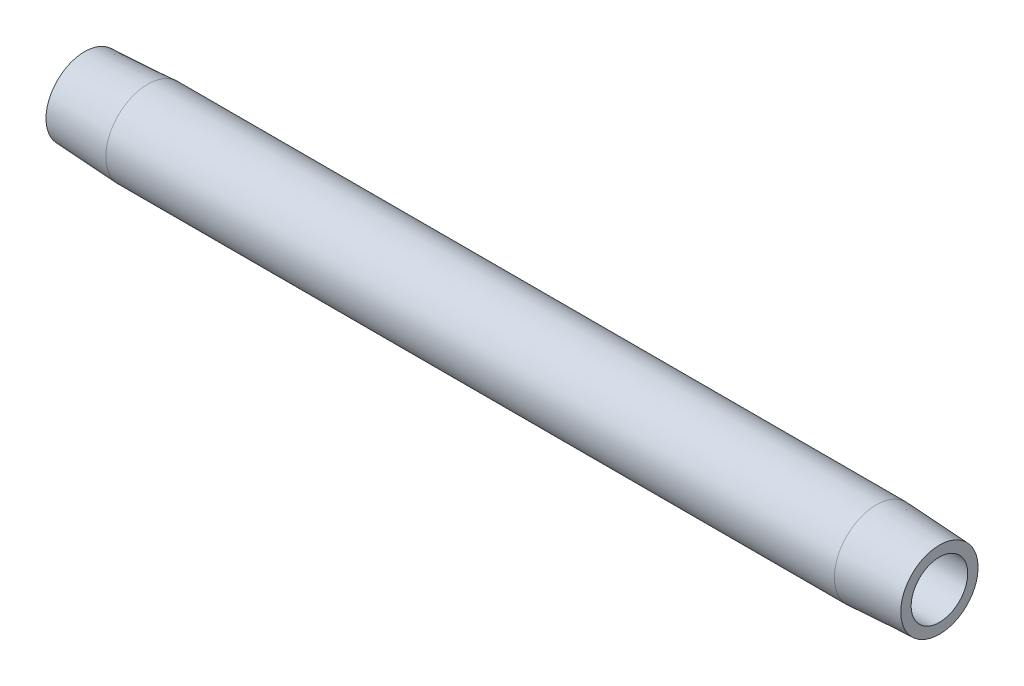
ISO-10303-21;
HEADER;
FILE_DESCRIPTION(('STEP AP214'),'2;1');
FILE_NAME('part.step','',(''),(''),'','','');
FILE_SCHEMA(('AUTOMOTIVE_DESIGN { 1 0 10303 214 1 1 1 1 }'));
ENDSEC;
DATA;
#1=APPLICATION_CONTEXT('core data for automotive mechanical design processes');
#2=APPLICATION_PROTOCOL_DEFINITION('international standard','automotive_design',2000,#1);
#3=PRODUCT_CONTEXT('',#1,'mechanical');
#4=PRODUCT('Part','Part','',(#3));
#5=PRODUCT_RELATED_PRODUCT_CATEGORY('part','',(#4));
#6=PRODUCT_DEFINITION_FORMATION('','',#4);
#7=PRODUCT_DEFINITION_CONTEXT('part definition',#1,'design');
#8=PRODUCT_DEFINITION('design','',#6,#7);
#9=PRODUCT_DEFINITION_SHAPE('','',#8);
#10=(LENGTH_UNIT() NAMED_UNIT(*) SI_UNIT(.MILLI.,.METRE.));
#11=(NAMED_UNIT(*) PLANE_ANGLE_UNIT() SI_UNIT($,.RADIAN.));
#12=(NAMED_UNIT(*) SI_UNIT($,.STERADIAN.) SOLID_ANGLE_UNIT());
#13=UNCERTAINTY_MEASURE_WITH_UNIT(LENGTH_MEASURE(1.E-05),#10,'distance_accuracy_value','');
#14=(GEOMETRIC_REPRESENTATION_CONTEXT(3) GLOBAL_UNCERTAINTY_ASSIGNED_CONTEXT((#13)) GLOBAL_UNIT_ASSIGNED_CONTEXT((#10,
#11,#12)) REPRESENTATION_CONTEXT('',''));
#15=CARTESIAN_POINT('',(0.,0.,0.));
#16=DIRECTION('',(0.,0.,1.));
#17=DIRECTION('',(1.,0.,0.));
#18=AXIS2_PLACEMENT_3D('',#15,#16,#17);
#19=CARTESIAN_POINT('',(139.7,0.,-4.62277681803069));
#20=DIRECTION('',(-1.,0.,0.));
#21=DIRECTION('',(0.,0.,1.));
#22=AXIS2_PLACEMENT_3D('',#19,#20,#21);
#23=PLANE('',#22);
#24=CARTESIAN_POINT('',(139.7,0.,0.));
#25=DIRECTION('',(-1.,0.,0.));
#26=DIRECTION('',(0.,0.,1.));
#27=AXIS2_PLACEMENT_3D('',#24,#25,#26);
#28=CIRCLE('',#27,6.31752683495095);
#29=CARTESIAN_POINT('',(139.7,0.,6.31752683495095));
#30=VERTEX_POINT('',#29);
#31=EDGE_CURVE('E10',#30,#30,#28,.T.);
#32=ORIENTED_EDGE('',*,*,#31,.F.);
#33=EDGE_LOOP('',(#32));
#34=FACE_BOUND('',#33,.T.);
#35=CARTESIAN_POINT('',(139.7,0.,0.));
#36=DIRECTION('',(-1.,0.,0.));
#37=DIRECTION('',(0.,0.,1.));
#38=AXIS2_PLACEMENT_3D('',#35,#36,#37);
#39=CIRCLE('',#38,4.62277681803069);
#40=CARTESIAN_POINT('',(139.7,0.,4.62277681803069));
#41=VERTEX_POINT('',#40);
#42=EDGE_CURVE('E52',#41,#41,#39,.T.);
#43=ORIENTED_EDGE('',*,*,#42,.T.);
#44=EDGE_LOOP('',(#43));
#45=FACE_BOUND('',#44,.T.);
#46=ADVANCED_FACE('F30',(#34,#45),#23,.F.);
#47=CARTESIAN_POINT('',(139.7,0.,0.));
#48=DIRECTION('',(-1.,0.,0.));
#49=DIRECTION('',(0.,0.,1.));
#50=AXIS2_PLACEMENT_3D('',#47,#48,#49);
#51=CONICAL_SURFACE('',#50,6.31752683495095,0.052359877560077);
#52=CARTESIAN_POINT('',(129.387600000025,0.,0.));
#53=DIRECTION('',(-1.,0.,0.));
#54=DIRECTION('',(0.,0.,1.));
#55=AXIS2_PLACEMENT_3D('',#52,#53,#54);
#56=CIRCLE('',#55,6.85797681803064);
#57=CARTESIAN_POINT('',(129.387600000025,0.,6.85797681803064));
#58=VERTEX_POINT('',#57);
#59=EDGE_CURVE('E36',#58,#58,#56,.T.);
#60=ORIENTED_EDGE('',*,*,#59,.F.);
#61=EDGE_LOOP('',(#60));
#62=FACE_BOUND('',#61,.T.);
#63=ORIENTED_EDGE('',*,*,#31,.T.);
#64=EDGE_LOOP('',(#63));
#65=FACE_BOUND('',#64,.T.);
#66=ADVANCED_FACE('F77',(#62,#65),#51,.T.);
#67=CARTESIAN_POINT('',(-6.37599469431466,0.,0.));
#68=DIRECTION('',(-1.,0.,0.));
#69=DIRECTION('',(0.,0.,1.));
#70=AXIS2_PLACEMENT_3D('',#67,#68,#69);
#71=CYLINDRICAL_SURFACE('',#70,6.85797681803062);
#72=CARTESIAN_POINT('',(10.3123999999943,0.,0.));
#73=DIRECTION('',(-1.,0.,0.));
#74=DIRECTION('',(0.,0.,1.));
#75=AXIS2_PLACEMENT_3D('',#72,#73,#74);
#76=CIRCLE('',#75,6.8579768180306);
#77=CARTESIAN_POINT('',(10.3123999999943,0.,6.8579768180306));
#78=VERTEX_POINT('',#77);
#79=EDGE_CURVE('E40',#78,#78,#76,.T.);
#80=ORIENTED_EDGE('',*,*,#79,.F.);
#81=EDGE_LOOP('',(#80));
#82=FACE_BOUND('',#81,.T.);
#83=ORIENTED_EDGE('',*,*,#59,.T.);
#84=EDGE_LOOP('',(#83));
#85=FACE_BOUND('',#84,.T.);
#86=ADVANCED_FACE('F72',(#82,#85),#71,.T.);
#87=CARTESIAN_POINT('',(10.3123999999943,0.,0.));
#88=DIRECTION('',(1.,0.,0.));
#89=DIRECTION('',(0.,0.,-1.));
#90=AXIS2_PLACEMENT_3D('',#87,#88,#89);
#91=CONICAL_SURFACE('',#90,6.8579768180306,0.0523598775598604);
#92=CARTESIAN_POINT('',(1.90819582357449E-11,0.,0.));
#93=DIRECTION('',(-1.,0.,0.));
#94=DIRECTION('',(0.,0.,1.));
#95=AXIS2_PLACEMENT_3D('',#92,#93,#94);
#96=CIRCLE('',#95,6.31752683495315);
#97=CARTESIAN_POINT('',(1.90819582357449E-11,0.,6.31752683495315));
#98=VERTEX_POINT('',#97);
#99=EDGE_CURVE('E44',#98,#98,#96,.T.);
#100=ORIENTED_EDGE('',*,*,#99,.F.);
#101=EDGE_LOOP('',(#100));
#102=FACE_BOUND('',#101,.T.);
#103=ORIENTED_EDGE('',*,*,#79,.T.);
#104=EDGE_LOOP('',(#103));
#105=FACE_BOUND('',#104,.T.);
#106=ADVANCED_FACE('F66',(#102,#105),#91,.T.);
#107=CARTESIAN_POINT('',(1.90819582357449E-11,0.,-6.31752683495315));
#108=DIRECTION('',(1.,0.,0.));
#109=DIRECTION('',(0.,0.,-1.));
#110=AXIS2_PLACEMENT_3D('',#107,#108,#109);
#111=PLANE('',#110);
#112=CARTESIAN_POINT('',(1.90819582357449E-11,0.,0.));
#113=DIRECTION('',(-1.,0.,0.));
#114=DIRECTION('',(0.,0.,1.));
#115=AXIS2_PLACEMENT_3D('',#112,#113,#114);
#116=CIRCLE('',#115,4.62277681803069);
#117=CARTESIAN_POINT('',(1.90819582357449E-11,0.,4.62277681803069));
#118=VERTEX_POINT('',#117);
#119=EDGE_CURVE('E49',#118,#118,#116,.T.);
#120=ORIENTED_EDGE('',*,*,#119,.F.);
#121=EDGE_LOOP('',(#120));
#122=FACE_BOUND('',#121,.T.);
#123=ORIENTED_EDGE('',*,*,#99,.T.);
#124=EDGE_LOOP('',(#123));
#125=FACE_BOUND('',#124,.T.);
#126=ADVANCED_FACE('F60',(#122,#125),#111,.F.);
#127=CARTESIAN_POINT('',(-6.37599469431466,0.,0.));
#128=DIRECTION('',(-1.,0.,0.));
#129=DIRECTION('',(0.,0.,1.));
#130=AXIS2_PLACEMENT_3D('',#127,#128,#129);
#131=CYLINDRICAL_SURFACE('',#130,4.62277681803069);
#132=ORIENTED_EDGE('',*,*,#42,.F.);
#133=EDGE_LOOP('',(#132));
#134=FACE_BOUND('',#133,.T.);
#135=ORIENTED_EDGE('',*,*,#119,.T.);
#136=EDGE_LOOP('',(#135));
#137=FACE_BOUND('',#136,.T.);
#138=ADVANCED_FACE('F57',(#134,#137),#131,.F.);
#139=CLOSED_SHELL('',(#46,#66,#86,#106,#126,#138));
#140=MANIFOLD_SOLID_BREP('B2',#139);
#141=ADVANCED_BREP_SHAPE_REPRESENTATION('',(#18,#140),#14);
#142=SHAPE_DEFINITION_REPRESENTATION(#9,#141);
ENDSEC;
END-ISO-10303-21;
